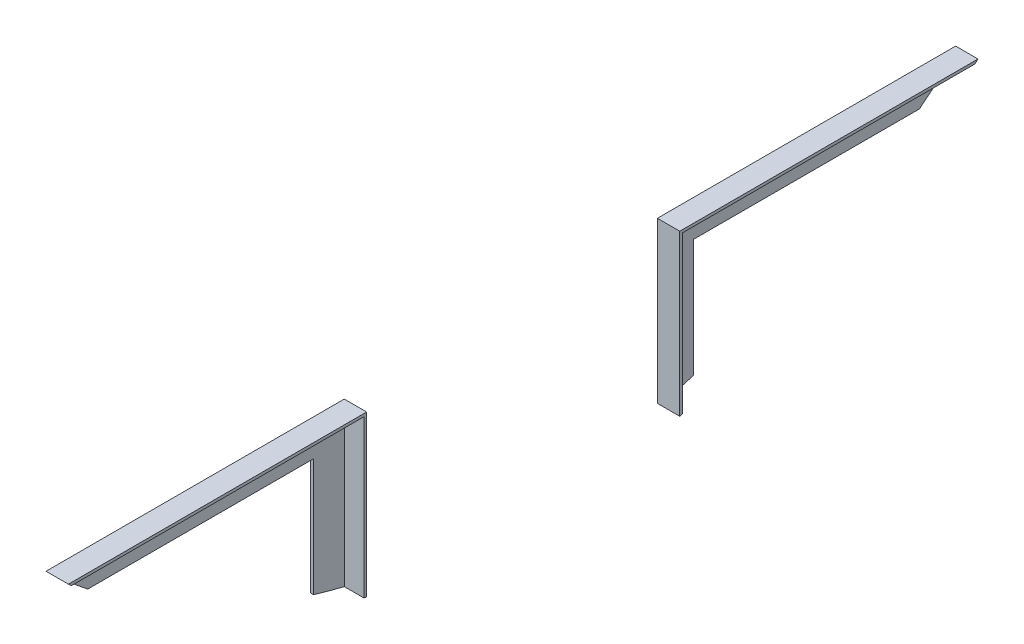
ISO-10303-21;
HEADER;
FILE_DESCRIPTION(('STEP AP214'),'2;1');
FILE_NAME('part.step','',(''),(''),'','','');
FILE_SCHEMA(('AUTOMOTIVE_DESIGN { 1 0 10303 214 1 1 1 1 }'));
ENDSEC;
DATA;
#1=APPLICATION_CONTEXT('core data for automotive mechanical design processes');
#2=APPLICATION_PROTOCOL_DEFINITION('international standard','automotive_design',2000,#1);
#3=PRODUCT_CONTEXT('',#1,'mechanical');
#4=PRODUCT('Part','Part','',(#3));
#5=PRODUCT_RELATED_PRODUCT_CATEGORY('part','',(#4));
#6=PRODUCT_DEFINITION_FORMATION('','',#4);
#7=PRODUCT_DEFINITION_CONTEXT('part definition',#1,'design');
#8=PRODUCT_DEFINITION('design','',#6,#7);
#9=PRODUCT_DEFINITION_SHAPE('','',#8);
#10=(LENGTH_UNIT() NAMED_UNIT(*) SI_UNIT(.MILLI.,.METRE.));
#11=(NAMED_UNIT(*) PLANE_ANGLE_UNIT() SI_UNIT($,.RADIAN.));
#12=(NAMED_UNIT(*) SI_UNIT($,.STERADIAN.) SOLID_ANGLE_UNIT());
#13=UNCERTAINTY_MEASURE_WITH_UNIT(LENGTH_MEASURE(1.E-05),#10,'distance_accuracy_value','');
#14=(GEOMETRIC_REPRESENTATION_CONTEXT(3) GLOBAL_UNCERTAINTY_ASSIGNED_CONTEXT((#13)) GLOBAL_UNIT_ASSIGNED_CONTEXT((#10,
#11,#12)) REPRESENTATION_CONTEXT('',''));
#15=CARTESIAN_POINT('',(0.,0.,0.));
#16=DIRECTION('',(0.,0.,1.));
#17=DIRECTION('',(1.,0.,0.));
#18=AXIS2_PLACEMENT_3D('',#15,#16,#17);
#19=CARTESIAN_POINT('',(6.34999999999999,406.4,787.4));
#20=DIRECTION('',(0.,0.,-1.));
#21=DIRECTION('',(1.,0.,0.));
#22=AXIS2_PLACEMENT_3D('',#19,#20,#21);
#23=PLANE('',#22);
#24=DIRECTION('',(-1.,0.,0.));
#25=VECTOR('',#24,1.);
#26=CARTESIAN_POINT('',(50.8,62.7923035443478,787.4));
#27=LINE('',#26,#25);
#28=CARTESIAN_POINT('',(0.,62.7923035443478,787.4));
#29=VERTEX_POINT('',#28);
#30=CARTESIAN_POINT('',(6.34999999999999,62.7923035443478,787.4));
#31=VERTEX_POINT('',#30);
#32=EDGE_CURVE('E147',#29,#31,#27,.F.);
#33=ORIENTED_EDGE('',*,*,#32,.T.);
#34=DIRECTION('',(0.,-1.,0.));
#35=VECTOR('',#34,1.);
#36=CARTESIAN_POINT('',(6.34999999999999,406.4,787.4));
#37=LINE('',#36,#35);
#38=CARTESIAN_POINT('',(6.35000000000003,330.2,787.4));
#39=VERTEX_POINT('',#38);
#40=EDGE_CURVE('E165',#39,#31,#37,.T.);
#41=ORIENTED_EDGE('',*,*,#40,.F.);
#42=DIRECTION('',(1.,0.,0.));
#43=VECTOR('',#42,1.);
#44=CARTESIAN_POINT('',(6.34999999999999,330.2,787.4));
#45=LINE('',#44,#43);
#46=CARTESIAN_POINT('',(0.,330.2,787.4));
#47=VERTEX_POINT('',#46);
#48=EDGE_CURVE('E155',#47,#39,#45,.T.);
#49=ORIENTED_EDGE('',*,*,#48,.F.);
#50=DIRECTION('',(0.,-1.,0.));
#51=VECTOR('',#50,1.);
#52=CARTESIAN_POINT('',(0.,406.4,787.4));
#53=LINE('',#52,#51);
#54=EDGE_CURVE('E178',#47,#29,#53,.T.);
#55=ORIENTED_EDGE('',*,*,#54,.T.);
#56=EDGE_LOOP('',(#33,#41,#49,#55));
#57=FACE_BOUND('',#56,.T.);
#58=ADVANCED_FACE('F42',(#57),#23,.F.);
#59=CARTESIAN_POINT('',(0.,406.4,787.4));
#60=DIRECTION('',(1.,0.,0.));
#61=DIRECTION('',(0.,0.,1.));
#62=AXIS2_PLACEMENT_3D('',#59,#60,#61);
#63=PLANE('',#62);
#64=CARTESIAN_POINT('',(0.,1516.0625,355.6));
#65=DIRECTION('',(1.,0.,0.));
#66=DIRECTION('',(0.,0.,-1.));
#67=AXIS2_PLACEMENT_3D('',#64,#65,#66);
#68=CIRCLE('',#67,1516.0625);
#69=CARTESIAN_POINT('',(0.,42.2938126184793,711.2));
#70=VERTEX_POINT('',#69);
#71=EDGE_CURVE('E136',#29,#70,#68,.T.);
#72=ORIENTED_EDGE('',*,*,#71,.F.);
#73=ORIENTED_EDGE('',*,*,#54,.F.);
#74=DIRECTION('',(0.,0.,-1.));
#75=VECTOR('',#74,1.);
#76=CARTESIAN_POINT('',(0.,330.2,1422.4));
#77=LINE('',#76,#75);
#78=CARTESIAN_POINT('',(0.,330.2,1300.15049362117));
#79=VERTEX_POINT('',#78);
#80=EDGE_CURVE('E134',#79,#47,#77,.T.);
#81=ORIENTED_EDGE('',*,*,#80,.F.);
#82=CARTESIAN_POINT('',(0.,406.4,1388.60272990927));
#83=VERTEX_POINT('',#82);
#84=EDGE_CURVE('E114',#83,#79,#68,.T.);
#85=ORIENTED_EDGE('',*,*,#84,.F.);
#86=DIRECTION('',(0.,0.,-1.));
#87=VECTOR('',#86,1.);
#88=CARTESIAN_POINT('',(0.,406.4,787.4));
#89=LINE('',#88,#87);
#90=CARTESIAN_POINT('',(0.,406.4,711.2));
#91=VERTEX_POINT('',#90);
#92=EDGE_CURVE('E123',#83,#91,#89,.T.);
#93=ORIENTED_EDGE('',*,*,#92,.T.);
#94=DIRECTION('',(0.,-1.,0.));
#95=VECTOR('',#94,1.);
#96=CARTESIAN_POINT('',(0.,406.4,711.2));
#97=LINE('',#96,#95);
#98=EDGE_CURVE('E176',#91,#70,#97,.T.);
#99=ORIENTED_EDGE('',*,*,#98,.T.);
#100=EDGE_LOOP('',(#72,#73,#81,#85,#93,#99));
#101=FACE_BOUND('',#100,.T.);
#102=ADVANCED_FACE('F132',(#101),#63,.F.);
#103=CARTESIAN_POINT('',(0.,406.4,711.2));
#104=DIRECTION('',(0.,0.,1.));
#105=DIRECTION('',(-1.,0.,0.));
#106=AXIS2_PLACEMENT_3D('',#103,#104,#105);
#107=PLANE('',#106);
#108=DIRECTION('',(-1.,0.,0.));
#109=VECTOR('',#108,1.);
#110=CARTESIAN_POINT('',(50.8,42.2938126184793,711.2));
#111=LINE('',#110,#109);
#112=CARTESIAN_POINT('',(50.8,42.2938126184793,711.2));
#113=VERTEX_POINT('',#112);
#114=EDGE_CURVE('E150',#113,#70,#111,.T.);
#115=ORIENTED_EDGE('',*,*,#114,.T.);
#116=ORIENTED_EDGE('',*,*,#98,.F.);
#117=DIRECTION('',(1.,0.,0.));
#118=VECTOR('',#117,1.);
#119=CARTESIAN_POINT('',(0.,406.4,711.2));
#120=LINE('',#119,#118);
#121=CARTESIAN_POINT('',(50.8,406.4,711.2));
#122=VERTEX_POINT('',#121);
#123=EDGE_CURVE('E126',#91,#122,#120,.T.);
#124=ORIENTED_EDGE('',*,*,#123,.T.);
#125=DIRECTION('',(0.,-1.,0.));
#126=VECTOR('',#125,1.);
#127=CARTESIAN_POINT('',(50.8,406.4,711.2));
#128=LINE('',#127,#126);
#129=EDGE_CURVE('E173',#122,#113,#128,.T.);
#130=ORIENTED_EDGE('',*,*,#129,.T.);
#131=EDGE_LOOP('',(#115,#116,#124,#130));
#132=FACE_BOUND('',#131,.T.);
#133=ADVANCED_FACE('F197',(#132),#107,.F.);
#134=CARTESIAN_POINT('',(50.8,406.4,711.2));
#135=DIRECTION('',(-1.,0.,0.));
#136=DIRECTION('',(0.,0.,-1.));
#137=AXIS2_PLACEMENT_3D('',#134,#135,#136);
#138=PLANE('',#137);
#139=CARTESIAN_POINT('',(50.8,1516.0625,355.6));
#140=DIRECTION('',(1.,0.,0.));
#141=DIRECTION('',(0.,0.,-1.));
#142=AXIS2_PLACEMENT_3D('',#139,#140,#141);
#143=CIRCLE('',#142,1516.0625);
#144=CARTESIAN_POINT('',(50.8,406.4,1388.60272990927));
#145=VERTEX_POINT('',#144);
#146=CARTESIAN_POINT('',(50.8,400.05,1381.7391736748));
#147=VERTEX_POINT('',#146);
#148=EDGE_CURVE('E117',#145,#147,#143,.T.);
#149=ORIENTED_EDGE('',*,*,#148,.T.);
#150=DIRECTION('',(0.,0.,-1.));
#151=VECTOR('',#150,1.);
#152=CARTESIAN_POINT('',(50.8,400.05,1422.4));
#153=LINE('',#152,#151);
#154=CARTESIAN_POINT('',(50.8,400.05,717.55));
#155=VERTEX_POINT('',#154);
#156=EDGE_CURVE('E152',#147,#155,#153,.T.);
#157=ORIENTED_EDGE('',*,*,#156,.T.);
#158=DIRECTION('',(0.,-1.,0.));
#159=VECTOR('',#158,1.);
#160=CARTESIAN_POINT('',(50.8,406.4,717.55));
#161=LINE('',#160,#159);
#162=CARTESIAN_POINT('',(50.8,43.8404714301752,717.55));
#163=VERTEX_POINT('',#162);
#164=EDGE_CURVE('E170',#155,#163,#161,.T.);
#165=ORIENTED_EDGE('',*,*,#164,.T.);
#166=EDGE_CURVE('E135',#163,#113,#143,.T.);
#167=ORIENTED_EDGE('',*,*,#166,.T.);
#168=ORIENTED_EDGE('',*,*,#129,.F.);
#169=DIRECTION('',(0.,0.,1.));
#170=VECTOR('',#169,1.);
#171=CARTESIAN_POINT('',(50.8,406.4,711.2));
#172=LINE('',#171,#170);
#173=EDGE_CURVE('E163',#122,#145,#172,.T.);
#174=ORIENTED_EDGE('',*,*,#173,.T.);
#175=EDGE_LOOP('',(#149,#157,#165,#167,#168,#174));
#176=FACE_BOUND('',#175,.T.);
#177=ADVANCED_FACE('F193',(#176),#138,.F.);
#178=CARTESIAN_POINT('',(50.8,406.4,717.55));
#179=DIRECTION('',(0.,0.,-1.));
#180=DIRECTION('',(1.,0.,0.));
#181=AXIS2_PLACEMENT_3D('',#178,#179,#180);
#182=PLANE('',#181);
#183=DIRECTION('',(-1.,0.,0.));
#184=VECTOR('',#183,1.);
#185=CARTESIAN_POINT('',(50.8,43.8404714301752,717.55));
#186=LINE('',#185,#184);
#187=CARTESIAN_POINT('',(6.35,43.8404714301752,717.55));
#188=VERTEX_POINT('',#187);
#189=EDGE_CURVE('E145',#188,#163,#186,.F.);
#190=ORIENTED_EDGE('',*,*,#189,.T.);
#191=ORIENTED_EDGE('',*,*,#164,.F.);
#192=DIRECTION('',(1.,0.,0.));
#193=VECTOR('',#192,1.);
#194=CARTESIAN_POINT('',(50.8,400.05,717.55));
#195=LINE('',#194,#193);
#196=CARTESIAN_POINT('',(6.35000000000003,400.05,717.55));
#197=VERTEX_POINT('',#196);
#198=EDGE_CURVE('E130',#197,#155,#195,.T.);
#199=ORIENTED_EDGE('',*,*,#198,.F.);
#200=DIRECTION('',(0.,-1.,0.));
#201=VECTOR('',#200,1.);
#202=CARTESIAN_POINT('',(6.35,406.4,717.55));
#203=LINE('',#202,#201);
#204=EDGE_CURVE('E167',#197,#188,#203,.T.);
#205=ORIENTED_EDGE('',*,*,#204,.T.);
#206=EDGE_LOOP('',(#190,#191,#199,#205));
#207=FACE_BOUND('',#206,.T.);
#208=ADVANCED_FACE('F190',(#207),#182,.F.);
#209=CARTESIAN_POINT('',(6.35,406.4,717.55));
#210=DIRECTION('',(-1.,0.,0.));
#211=DIRECTION('',(0.,0.,-1.));
#212=AXIS2_PLACEMENT_3D('',#209,#210,#211);
#213=PLANE('',#212);
#214=CARTESIAN_POINT('',(6.35000000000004,1516.0625,355.6));
#215=DIRECTION('',(1.,0.,0.));
#216=DIRECTION('',(0.,0.,-1.));
#217=AXIS2_PLACEMENT_3D('',#214,#215,#216);
#218=CIRCLE('',#217,1516.0625);
#219=CARTESIAN_POINT('',(6.34999999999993,400.05,1381.7391736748));
#220=VERTEX_POINT('',#219);
#221=CARTESIAN_POINT('',(6.35000000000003,330.2,1300.15049362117));
#222=VERTEX_POINT('',#221);
#223=EDGE_CURVE('E141',#220,#222,#218,.T.);
#224=ORIENTED_EDGE('',*,*,#223,.T.);
#225=DIRECTION('',(0.,0.,-1.));
#226=VECTOR('',#225,1.);
#227=CARTESIAN_POINT('',(6.35000000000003,330.2,1422.4));
#228=LINE('',#227,#226);
#229=EDGE_CURVE('E156',#222,#39,#228,.T.);
#230=ORIENTED_EDGE('',*,*,#229,.T.);
#231=ORIENTED_EDGE('',*,*,#40,.T.);
#232=EDGE_CURVE('E56',#31,#188,#218,.T.);
#233=ORIENTED_EDGE('',*,*,#232,.T.);
#234=ORIENTED_EDGE('',*,*,#204,.F.);
#235=DIRECTION('',(0.,0.,-1.));
#236=VECTOR('',#235,1.);
#237=CARTESIAN_POINT('',(6.35,400.05,717.55));
#238=LINE('',#237,#236);
#239=EDGE_CURVE('E49',#220,#197,#238,.T.);
#240=ORIENTED_EDGE('',*,*,#239,.F.);
#241=EDGE_LOOP('',(#224,#230,#231,#233,#234,#240));
#242=FACE_BOUND('',#241,.T.);
#243=ADVANCED_FACE('F188',(#242),#213,.F.);
#244=CARTESIAN_POINT('',(0.,406.4,711.2));
#245=DIRECTION('',(0.,1.,0.));
#246=DIRECTION('',(0.,0.,-1.));
#247=AXIS2_PLACEMENT_3D('',#244,#245,#246);
#248=PLANE('',#247);
#249=ORIENTED_EDGE('',*,*,#173,.F.);
#250=ORIENTED_EDGE('',*,*,#123,.F.);
#251=ORIENTED_EDGE('',*,*,#92,.F.);
#252=DIRECTION('',(-1.,0.,0.));
#253=VECTOR('',#252,1.);
#254=CARTESIAN_POINT('',(50.8,406.4,1388.60272990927));
#255=LINE('',#254,#253);
#256=EDGE_CURVE('E110',#145,#83,#255,.T.);
#257=ORIENTED_EDGE('',*,*,#256,.F.);
#258=EDGE_LOOP('',(#249,#250,#251,#257));
#259=FACE_BOUND('',#258,.T.);
#260=ADVANCED_FACE('F124',(#259),#248,.T.);
#261=CARTESIAN_POINT('',(6.35000000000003,400.05,1422.4));
#262=DIRECTION('',(0.,-1.,0.));
#263=DIRECTION('',(0.,0.,1.));
#264=AXIS2_PLACEMENT_3D('',#261,#262,#263);
#265=PLANE('',#264);
#266=ORIENTED_EDGE('',*,*,#239,.T.);
#267=ORIENTED_EDGE('',*,*,#198,.T.);
#268=ORIENTED_EDGE('',*,*,#156,.F.);
#269=DIRECTION('',(-1.,0.,0.));
#270=VECTOR('',#269,1.);
#271=CARTESIAN_POINT('',(50.8,400.05,1381.7391736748));
#272=LINE('',#271,#270);
#273=EDGE_CURVE('E120',#220,#147,#272,.F.);
#274=ORIENTED_EDGE('',*,*,#273,.F.);
#275=EDGE_LOOP('',(#266,#267,#268,#274));
#276=FACE_BOUND('',#275,.T.);
#277=ADVANCED_FACE('F183',(#276),#265,.T.);
#278=CARTESIAN_POINT('',(0.,330.2,1422.4));
#279=DIRECTION('',(0.,-1.,0.));
#280=DIRECTION('',(0.,0.,1.));
#281=AXIS2_PLACEMENT_3D('',#278,#279,#280);
#282=PLANE('',#281);
#283=ORIENTED_EDGE('',*,*,#80,.T.);
#284=ORIENTED_EDGE('',*,*,#48,.T.);
#285=ORIENTED_EDGE('',*,*,#229,.F.);
#286=DIRECTION('',(-1.,0.,0.));
#287=VECTOR('',#286,1.);
#288=CARTESIAN_POINT('',(50.8,330.2,1300.15049362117));
#289=LINE('',#288,#287);
#290=EDGE_CURVE('E12',#79,#222,#289,.F.);
#291=ORIENTED_EDGE('',*,*,#290,.F.);
#292=EDGE_LOOP('',(#283,#284,#285,#291));
#293=FACE_BOUND('',#292,.T.);
#294=ADVANCED_FACE('F203',(#293),#282,.T.);
#295=CARTESIAN_POINT('',(50.8,1516.0625,355.6));
#296=DIRECTION('',(-1.,0.,0.));
#297=DIRECTION('',(0.,0.,-1.));
#298=AXIS2_PLACEMENT_3D('',#295,#296,#297);
#299=CYLINDRICAL_SURFACE('',#298,1516.0625);
#300=ORIENTED_EDGE('',*,*,#148,.F.);
#301=ORIENTED_EDGE('',*,*,#256,.T.);
#302=ORIENTED_EDGE('',*,*,#84,.T.);
#303=ORIENTED_EDGE('',*,*,#290,.T.);
#304=ORIENTED_EDGE('',*,*,#223,.F.);
#305=ORIENTED_EDGE('',*,*,#273,.T.);
#306=EDGE_LOOP('',(#300,#301,#302,#303,#304,#305));
#307=FACE_BOUND('',#306,.T.);
#308=ADVANCED_FACE('F112',(#307),#299,.T.);
#309=ORIENTED_EDGE('',*,*,#114,.F.);
#310=ORIENTED_EDGE('',*,*,#166,.F.);
#311=ORIENTED_EDGE('',*,*,#189,.F.);
#312=ORIENTED_EDGE('',*,*,#232,.F.);
#313=ORIENTED_EDGE('',*,*,#32,.F.);
#314=ORIENTED_EDGE('',*,*,#71,.T.);
#315=EDGE_LOOP('',(#309,#310,#311,#312,#313,#314));
#316=FACE_BOUND('',#315,.T.);
#317=ADVANCED_FACE('F198',(#316),#299,.T.);
#318=CLOSED_SHELL('',(#58,#102,#133,#177,#208,#243,#260,#277,#294,#308,#317));
#319=MANIFOLD_SOLID_BREP('B2',#318);
#320=CARTESIAN_POINT('',(6.34999999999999,406.4,-76.2));
#321=DIRECTION('',(0.,0.,1.));
#322=DIRECTION('',(1.,0.,0.));
#323=AXIS2_PLACEMENT_3D('',#320,#321,#322);
#324=PLANE('',#323);
#325=DIRECTION('',(-1.,0.,0.));
#326=VECTOR('',#325,1.);
#327=CARTESIAN_POINT('',(50.8,62.7923035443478,-76.2));
#328=LINE('',#327,#326);
#329=CARTESIAN_POINT('',(0.,62.7923035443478,-76.2));
#330=VERTEX_POINT('',#329);
#331=CARTESIAN_POINT('',(6.34999999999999,62.7923035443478,-76.2));
#332=VERTEX_POINT('',#331);
#333=EDGE_CURVE('E317',#330,#332,#328,.F.);
#334=ORIENTED_EDGE('',*,*,#333,.F.);
#335=DIRECTION('',(0.,-1.,0.));
#336=VECTOR('',#335,1.);
#337=CARTESIAN_POINT('',(0.,406.4,-76.2));
#338=LINE('',#337,#336);
#339=CARTESIAN_POINT('',(0.,330.2,-76.2));
#340=VERTEX_POINT('',#339);
#341=EDGE_CURVE('E419',#340,#330,#338,.T.);
#342=ORIENTED_EDGE('',*,*,#341,.F.);
#343=DIRECTION('',(1.,0.,0.));
#344=VECTOR('',#343,1.);
#345=CARTESIAN_POINT('',(6.34999999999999,330.2,-76.2));
#346=LINE('',#345,#344);
#347=CARTESIAN_POINT('',(6.35000000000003,330.2,-76.2));
#348=VERTEX_POINT('',#347);
#349=EDGE_CURVE('E401',#340,#348,#346,.T.);
#350=ORIENTED_EDGE('',*,*,#349,.T.);
#351=DIRECTION('',(0.,-1.,0.));
#352=VECTOR('',#351,1.);
#353=CARTESIAN_POINT('',(6.34999999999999,406.4,-76.2));
#354=LINE('',#353,#352);
#355=EDGE_CURVE('E406',#348,#332,#354,.T.);
#356=ORIENTED_EDGE('',*,*,#355,.T.);
#357=EDGE_LOOP('',(#334,#342,#350,#356));
#358=FACE_BOUND('',#357,.T.);
#359=ADVANCED_FACE('F303',(#358),#324,.F.);
#360=CARTESIAN_POINT('',(0.,406.4,-76.2));
#361=DIRECTION('',(1.,0.,0.));
#362=DIRECTION('',(0.,0.,-1.));
#363=AXIS2_PLACEMENT_3D('',#360,#361,#362);
#364=PLANE('',#363);
#365=CARTESIAN_POINT('',(0.,1516.0625,355.6));
#366=DIRECTION('',(-1.,0.,0.));
#367=DIRECTION('',(0.,0.,1.));
#368=AXIS2_PLACEMENT_3D('',#365,#366,#367);
#369=CIRCLE('',#368,1516.0625);
#370=CARTESIAN_POINT('',(0.,42.2938126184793,0.));
#371=VERTEX_POINT('',#370);
#372=EDGE_CURVE('E379',#330,#371,#369,.T.);
#373=ORIENTED_EDGE('',*,*,#372,.T.);
#374=DIRECTION('',(0.,-1.,0.));
#375=VECTOR('',#374,1.);
#376=CARTESIAN_POINT('',(0.,406.4,0.));
#377=LINE('',#376,#375);
#378=CARTESIAN_POINT('',(0.,406.4,0.));
#379=VERTEX_POINT('',#378);
#380=EDGE_CURVE('E394',#379,#371,#377,.T.);
#381=ORIENTED_EDGE('',*,*,#380,.F.);
#382=DIRECTION('',(0.,0.,1.));
#383=VECTOR('',#382,1.);
#384=CARTESIAN_POINT('',(0.,406.4,-76.2));
#385=LINE('',#384,#383);
#386=CARTESIAN_POINT('',(0.,406.4,-677.402729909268));
#387=VERTEX_POINT('',#386);
#388=EDGE_CURVE('E384',#387,#379,#385,.T.);
#389=ORIENTED_EDGE('',*,*,#388,.F.);
#390=CARTESIAN_POINT('',(0.,330.2,-588.950493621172));
#391=VERTEX_POINT('',#390);
#392=EDGE_CURVE('E370',#387,#391,#369,.T.);
#393=ORIENTED_EDGE('',*,*,#392,.T.);
#394=DIRECTION('',(0.,0.,1.));
#395=VECTOR('',#394,1.);
#396=CARTESIAN_POINT('',(0.,330.2,-711.2));
#397=LINE('',#396,#395);
#398=EDGE_CURVE('E445',#391,#340,#397,.T.);
#399=ORIENTED_EDGE('',*,*,#398,.T.);
#400=ORIENTED_EDGE('',*,*,#341,.T.);
#401=EDGE_LOOP('',(#373,#381,#389,#393,#399,#400));
#402=FACE_BOUND('',#401,.T.);
#403=ADVANCED_FACE('F392',(#402),#364,.F.);
#404=CARTESIAN_POINT('',(0.,406.4,0.));
#405=DIRECTION('',(0.,0.,-1.));
#406=DIRECTION('',(-1.,0.,0.));
#407=AXIS2_PLACEMENT_3D('',#404,#405,#406);
#408=PLANE('',#407);
#409=DIRECTION('',(-1.,0.,0.));
#410=VECTOR('',#409,1.);
#411=CARTESIAN_POINT('',(50.8,42.2938126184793,0.));
#412=LINE('',#411,#410);
#413=CARTESIAN_POINT('',(50.8,42.2938126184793,0.));
#414=VERTEX_POINT('',#413);
#415=EDGE_CURVE('E439',#414,#371,#412,.T.);
#416=ORIENTED_EDGE('',*,*,#415,.F.);
#417=DIRECTION('',(0.,-1.,0.));
#418=VECTOR('',#417,1.);
#419=CARTESIAN_POINT('',(50.8,406.4,0.));
#420=LINE('',#419,#418);
#421=CARTESIAN_POINT('',(50.8,406.4,0.));
#422=VERTEX_POINT('',#421);
#423=EDGE_CURVE('E415',#422,#414,#420,.T.);
#424=ORIENTED_EDGE('',*,*,#423,.F.);
#425=DIRECTION('',(1.,0.,0.));
#426=VECTOR('',#425,1.);
#427=CARTESIAN_POINT('',(0.,406.4,0.));
#428=LINE('',#427,#426);
#429=EDGE_CURVE('E396',#379,#422,#428,.T.);
#430=ORIENTED_EDGE('',*,*,#429,.F.);
#431=ORIENTED_EDGE('',*,*,#380,.T.);
#432=EDGE_LOOP('',(#416,#424,#430,#431));
#433=FACE_BOUND('',#432,.T.);
#434=ADVANCED_FACE('F468',(#433),#408,.F.);
#435=CARTESIAN_POINT('',(50.8,406.4,0.));
#436=DIRECTION('',(-1.,0.,0.));
#437=DIRECTION('',(0.,0.,1.));
#438=AXIS2_PLACEMENT_3D('',#435,#436,#437);
#439=PLANE('',#438);
#440=CARTESIAN_POINT('',(50.8,1516.0625,355.6));
#441=DIRECTION('',(-1.,0.,0.));
#442=DIRECTION('',(0.,0.,1.));
#443=AXIS2_PLACEMENT_3D('',#440,#441,#442);
#444=CIRCLE('',#443,1516.0625);
#445=CARTESIAN_POINT('',(50.8,406.4,-677.402729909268));
#446=VERTEX_POINT('',#445);
#447=CARTESIAN_POINT('',(50.8,400.05,-670.539173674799));
#448=VERTEX_POINT('',#447);
#449=EDGE_CURVE('E560',#446,#448,#444,.T.);
#450=ORIENTED_EDGE('',*,*,#449,.F.);
#451=DIRECTION('',(0.,0.,-1.));
#452=VECTOR('',#451,1.);
#453=CARTESIAN_POINT('',(50.8,406.4,0.));
#454=LINE('',#453,#452);
#455=EDGE_CURVE('E387',#422,#446,#454,.T.);
#456=ORIENTED_EDGE('',*,*,#455,.F.);
#457=ORIENTED_EDGE('',*,*,#423,.T.);
#458=CARTESIAN_POINT('',(50.8,43.8404714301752,-6.35000000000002));
#459=VERTEX_POINT('',#458);
#460=EDGE_CURVE('E378',#459,#414,#444,.T.);
#461=ORIENTED_EDGE('',*,*,#460,.F.);
#462=DIRECTION('',(0.,-1.,0.));
#463=VECTOR('',#462,1.);
#464=CARTESIAN_POINT('',(50.8,406.4,-6.35));
#465=LINE('',#464,#463);
#466=CARTESIAN_POINT('',(50.8,400.05,-6.34999999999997));
#467=VERTEX_POINT('',#466);
#468=EDGE_CURVE('E412',#467,#459,#465,.T.);
#469=ORIENTED_EDGE('',*,*,#468,.F.);
#470=DIRECTION('',(0.,0.,1.));
#471=VECTOR('',#470,1.);
#472=CARTESIAN_POINT('',(50.8,400.05,-711.2));
#473=LINE('',#472,#471);
#474=EDGE_CURVE('E431',#448,#467,#473,.T.);
#475=ORIENTED_EDGE('',*,*,#474,.F.);
#476=EDGE_LOOP('',(#450,#456,#457,#461,#469,#475));
#477=FACE_BOUND('',#476,.T.);
#478=ADVANCED_FACE('F472',(#477),#439,.F.);
#479=CARTESIAN_POINT('',(50.8,406.4,-6.35));
#480=DIRECTION('',(0.,0.,1.));
#481=DIRECTION('',(1.,0.,0.));
#482=AXIS2_PLACEMENT_3D('',#479,#480,#481);
#483=PLANE('',#482);
#484=DIRECTION('',(-1.,0.,0.));
#485=VECTOR('',#484,1.);
#486=CARTESIAN_POINT('',(50.8,43.8404714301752,-6.35000000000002));
#487=LINE('',#486,#485);
#488=CARTESIAN_POINT('',(6.35,43.8404714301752,-6.35000000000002));
#489=VERTEX_POINT('',#488);
#490=EDGE_CURVE('E436',#489,#459,#487,.F.);
#491=ORIENTED_EDGE('',*,*,#490,.F.);
#492=DIRECTION('',(0.,-1.,0.));
#493=VECTOR('',#492,1.);
#494=CARTESIAN_POINT('',(6.35,406.4,-6.35));
#495=LINE('',#494,#493);
#496=CARTESIAN_POINT('',(6.35000000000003,400.05,-6.34999999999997));
#497=VERTEX_POINT('',#496);
#498=EDGE_CURVE('E409',#497,#489,#495,.T.);
#499=ORIENTED_EDGE('',*,*,#498,.F.);
#500=DIRECTION('',(1.,0.,0.));
#501=VECTOR('',#500,1.);
#502=CARTESIAN_POINT('',(50.8,400.05,-6.35));
#503=LINE('',#502,#501);
#504=EDGE_CURVE('E397',#497,#467,#503,.T.);
#505=ORIENTED_EDGE('',*,*,#504,.T.);
#506=ORIENTED_EDGE('',*,*,#468,.T.);
#507=EDGE_LOOP('',(#491,#499,#505,#506));
#508=FACE_BOUND('',#507,.T.);
#509=ADVANCED_FACE('F435',(#508),#483,.F.);
#510=CARTESIAN_POINT('',(6.35,406.4,-6.35));
#511=DIRECTION('',(-1.,0.,0.));
#512=DIRECTION('',(0.,0.,1.));
#513=AXIS2_PLACEMENT_3D('',#510,#511,#512);
#514=PLANE('',#513);
#515=CARTESIAN_POINT('',(6.35000000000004,1516.0625,355.6));
#516=DIRECTION('',(-1.,0.,0.));
#517=DIRECTION('',(0.,0.,1.));
#518=AXIS2_PLACEMENT_3D('',#515,#516,#517);
#519=CIRCLE('',#518,1516.0625);
#520=CARTESIAN_POINT('',(6.34999999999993,400.05,-670.539173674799));
#521=VERTEX_POINT('',#520);
#522=CARTESIAN_POINT('',(6.35000000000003,330.2,-588.950493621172));
#523=VERTEX_POINT('',#522);
#524=EDGE_CURVE('E325',#521,#523,#519,.T.);
#525=ORIENTED_EDGE('',*,*,#524,.F.);
#526=DIRECTION('',(0.,0.,1.));
#527=VECTOR('',#526,1.);
#528=CARTESIAN_POINT('',(6.35,400.05,-6.35));
#529=LINE('',#528,#527);
#530=EDGE_CURVE('E310',#521,#497,#529,.T.);
#531=ORIENTED_EDGE('',*,*,#530,.T.);
#532=ORIENTED_EDGE('',*,*,#498,.T.);
#533=EDGE_CURVE('E388',#332,#489,#519,.T.);
#534=ORIENTED_EDGE('',*,*,#533,.F.);
#535=ORIENTED_EDGE('',*,*,#355,.F.);
#536=DIRECTION('',(0.,0.,1.));
#537=VECTOR('',#536,1.);
#538=CARTESIAN_POINT('',(6.35000000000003,330.2,-711.2));
#539=LINE('',#538,#537);
#540=EDGE_CURVE('E447',#523,#348,#539,.T.);
#541=ORIENTED_EDGE('',*,*,#540,.F.);
#542=EDGE_LOOP('',(#525,#531,#532,#534,#535,#541));
#543=FACE_BOUND('',#542,.T.);
#544=ADVANCED_FACE('F424',(#543),#514,.F.);
#545=CARTESIAN_POINT('',(0.,406.4,0.));
#546=DIRECTION('',(0.,1.,0.));
#547=DIRECTION('',(0.,0.,1.));
#548=AXIS2_PLACEMENT_3D('',#545,#546,#547);
#549=PLANE('',#548);
#550=ORIENTED_EDGE('',*,*,#455,.T.);
#551=DIRECTION('',(-1.,0.,0.));
#552=VECTOR('',#551,1.);
#553=CARTESIAN_POINT('',(50.8,406.4,-677.402729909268));
#554=LINE('',#553,#552);
#555=EDGE_CURVE('E373',#446,#387,#554,.T.);
#556=ORIENTED_EDGE('',*,*,#555,.T.);
#557=ORIENTED_EDGE('',*,*,#388,.T.);
#558=ORIENTED_EDGE('',*,*,#429,.T.);
#559=EDGE_LOOP('',(#550,#556,#557,#558));
#560=FACE_BOUND('',#559,.T.);
#561=ADVANCED_FACE('F383',(#560),#549,.T.);
#562=CARTESIAN_POINT('',(6.35000000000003,400.05,-711.2));
#563=DIRECTION('',(0.,-1.,0.));
#564=DIRECTION('',(0.,0.,-1.));
#565=AXIS2_PLACEMENT_3D('',#562,#563,#564);
#566=PLANE('',#565);
#567=ORIENTED_EDGE('',*,*,#530,.F.);
#568=DIRECTION('',(-1.,0.,0.));
#569=VECTOR('',#568,1.);
#570=CARTESIAN_POINT('',(50.8,400.05,-670.539173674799));
#571=LINE('',#570,#569);
#572=EDGE_CURVE('E389',#521,#448,#571,.F.);
#573=ORIENTED_EDGE('',*,*,#572,.T.);
#574=ORIENTED_EDGE('',*,*,#474,.T.);
#575=ORIENTED_EDGE('',*,*,#504,.F.);
#576=EDGE_LOOP('',(#567,#573,#574,#575));
#577=FACE_BOUND('',#576,.T.);
#578=ADVANCED_FACE('F429',(#577),#566,.T.);
#579=CARTESIAN_POINT('',(0.,330.2,-711.2));
#580=DIRECTION('',(0.,-1.,0.));
#581=DIRECTION('',(0.,0.,-1.));
#582=AXIS2_PLACEMENT_3D('',#579,#580,#581);
#583=PLANE('',#582);
#584=ORIENTED_EDGE('',*,*,#398,.F.);
#585=DIRECTION('',(-1.,0.,0.));
#586=VECTOR('',#585,1.);
#587=CARTESIAN_POINT('',(50.8,330.2,-588.950493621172));
#588=LINE('',#587,#586);
#589=EDGE_CURVE('E40',#391,#523,#588,.F.);
#590=ORIENTED_EDGE('',*,*,#589,.T.);
#591=ORIENTED_EDGE('',*,*,#540,.T.);
#592=ORIENTED_EDGE('',*,*,#349,.F.);
#593=EDGE_LOOP('',(#584,#590,#591,#592));
#594=FACE_BOUND('',#593,.T.);
#595=ADVANCED_FACE('F462',(#594),#583,.T.);
#596=CARTESIAN_POINT('',(50.8,1516.0625,355.6));
#597=DIRECTION('',(-1.,0.,0.));
#598=DIRECTION('',(0.,0.,1.));
#599=AXIS2_PLACEMENT_3D('',#596,#597,#598);
#600=CYLINDRICAL_SURFACE('',#599,1516.0625);
#601=ORIENTED_EDGE('',*,*,#449,.T.);
#602=ORIENTED_EDGE('',*,*,#572,.F.);
#603=ORIENTED_EDGE('',*,*,#524,.T.);
#604=ORIENTED_EDGE('',*,*,#589,.F.);
#605=ORIENTED_EDGE('',*,*,#392,.F.);
#606=ORIENTED_EDGE('',*,*,#555,.F.);
#607=EDGE_LOOP('',(#601,#602,#603,#604,#605,#606));
#608=FACE_BOUND('',#607,.T.);
#609=ADVANCED_FACE('F372',(#608),#600,.T.);
#610=ORIENTED_EDGE('',*,*,#415,.T.);
#611=ORIENTED_EDGE('',*,*,#372,.F.);
#612=ORIENTED_EDGE('',*,*,#333,.T.);
#613=ORIENTED_EDGE('',*,*,#533,.T.);
#614=ORIENTED_EDGE('',*,*,#490,.T.);
#615=ORIENTED_EDGE('',*,*,#460,.T.);
#616=EDGE_LOOP('',(#610,#611,#612,#613,#614,#615));
#617=FACE_BOUND('',#616,.T.);
#618=ADVANCED_FACE('F455',(#617),#600,.T.);
#619=CLOSED_SHELL('',(#359,#403,#434,#478,#509,#544,#561,#578,#595,#609,#618));
#620=MANIFOLD_SOLID_BREP('B6',#619);
#621=ADVANCED_BREP_SHAPE_REPRESENTATION('',(#18,#319,#620),#14);
#622=SHAPE_DEFINITION_REPRESENTATION(#9,#621);
ENDSEC;
END-ISO-10303-21;
